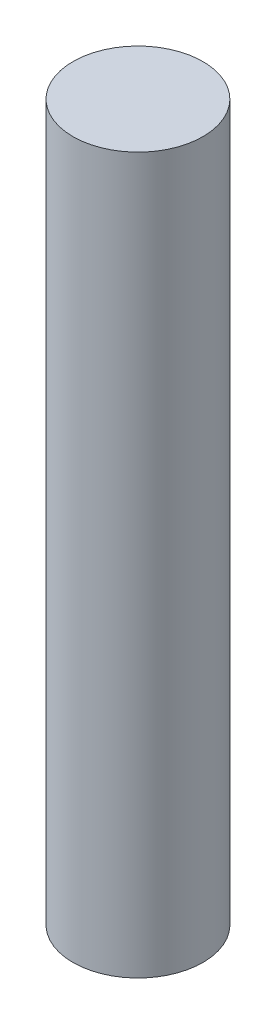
from build123d import *

# Parameters (mm, degrees)
SKETCH3_R           = 1.5
BOSS_EXTRUDE2_DEPTH = 16.5
SKETCH6_W           = 1
SKETCH6_H           = 3
CUT_EXTRUDE2_DEPTH  = 1
SKETCH7_W           = 1
SKETCH7_H           = 1.5
CUT_EXTRUDE3_DEPTH  = 1.5


with BuildPart() as part:
    # Sketch3 → Boss-Extrude2 (new body)
    with BuildSketch(Plane(origin=(0, 0, 0), x_dir=(1, 0, 0), z_dir=(0, 1, 0))):
        with Locations(Location((1.5, 0, 0), (0, 0, 270))):
            Circle(SKETCH3_R)
    extrude(amount=BOSS_EXTRUDE2_DEPTH)

    # Sketch6 → Cut-Extrude2 (cut)
    with BuildSketch(Plane(origin=(0, 0, 0), x_dir=(0, 0, -1), z_dir=(1, 0, 0))):
        with Locations((0, 9)):
            Rectangle(SKETCH6_W, SKETCH6_H)
    extrude(amount=CUT_EXTRUDE2_DEPTH, mode=Mode.SUBTRACT)

    # Sketch7 → Cut-Extrude3 (cut)
    with BuildSketch(Plane(origin=(0, 0, 0), x_dir=(0, 0, -1), z_dir=(1, 0, 0))):
        with Locations((0, 8.25)):
            Rectangle(SKETCH7_W, SKETCH7_H)
    extrude(amount=CUT_EXTRUDE3_DEPTH, mode=Mode.SUBTRACT)


solid = part.part
